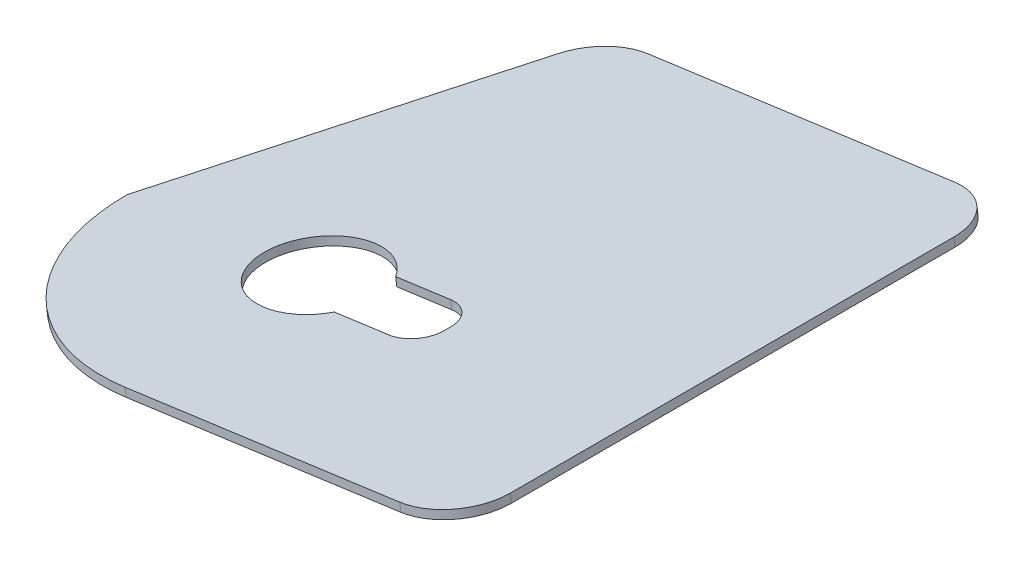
ISO-10303-21;
HEADER;
FILE_DESCRIPTION(('STEP AP214'),'2;1');
FILE_NAME('part.step','',(''),(''),'','','');
FILE_SCHEMA(('AUTOMOTIVE_DESIGN { 1 0 10303 214 1 1 1 1 }'));
ENDSEC;
DATA;
#1=APPLICATION_CONTEXT('core data for automotive mechanical design processes');
#2=APPLICATION_PROTOCOL_DEFINITION('international standard','automotive_design',2000,#1);
#3=PRODUCT_CONTEXT('',#1,'mechanical');
#4=PRODUCT('Part','Part','',(#3));
#5=PRODUCT_RELATED_PRODUCT_CATEGORY('part','',(#4));
#6=PRODUCT_DEFINITION_FORMATION('','',#4);
#7=PRODUCT_DEFINITION_CONTEXT('part definition',#1,'design');
#8=PRODUCT_DEFINITION('design','',#6,#7);
#9=PRODUCT_DEFINITION_SHAPE('','',#8);
#10=(LENGTH_UNIT() NAMED_UNIT(*) SI_UNIT(.MILLI.,.METRE.));
#11=(NAMED_UNIT(*) PLANE_ANGLE_UNIT() SI_UNIT($,.RADIAN.));
#12=(NAMED_UNIT(*) SI_UNIT($,.STERADIAN.) SOLID_ANGLE_UNIT());
#13=UNCERTAINTY_MEASURE_WITH_UNIT(LENGTH_MEASURE(1.E-05),#10,'distance_accuracy_value','');
#14=(GEOMETRIC_REPRESENTATION_CONTEXT(3) GLOBAL_UNCERTAINTY_ASSIGNED_CONTEXT((#13)) GLOBAL_UNIT_ASSIGNED_CONTEXT((#10,
#11,#12)) REPRESENTATION_CONTEXT('',''));
#15=CARTESIAN_POINT('',(0.,0.,0.));
#16=DIRECTION('',(0.,0.,1.));
#17=DIRECTION('',(1.,0.,0.));
#18=AXIS2_PLACEMENT_3D('',#15,#16,#17);
#19=CARTESIAN_POINT('',(15.02308683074,1.636620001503,68.5));
#20=DIRECTION('',(-0.136363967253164,0.990658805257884,0.));
#21=DIRECTION('',(-0.990658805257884,-0.136363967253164,0.));
#22=AXIS2_PLACEMENT_3D('',#19,#20,#21);
#23=PLANE('',#22);
#24=DIRECTION('',(0.990658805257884,0.136363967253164,0.));
#25=VECTOR('',#24,1.);
#26=CARTESIAN_POINT('',(10.129232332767,0.9629820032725,74.6467013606));
#27=LINE('',#26,#25);
#28=CARTESIAN_POINT('',(10.7067695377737,1.04247987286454,74.6467013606));
#29=VERTEX_POINT('',#28);
#30=CARTESIAN_POINT('',(9.71611073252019,0.906115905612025,74.6467013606));
#31=VERTEX_POINT('',#30);
#32=EDGE_CURVE('E119',#29,#31,#27,.F.);
#33=ORIENTED_EDGE('',*,*,#32,.F.);
#34=CARTESIAN_POINT('',(10.706769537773,1.04247987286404,75.1467013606));
#35=DIRECTION('',(0.136363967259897,-0.990658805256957,0.));
#36=DIRECTION('',(0.990658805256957,0.136363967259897,0.));
#37=AXIS2_PLACEMENT_3D('',#34,#35,#36);
#38=CIRCLE('',#37,0.500000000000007);
#39=CARTESIAN_POINT('',(11.2020989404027,1.11066185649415,75.1467013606));
#40=VERTEX_POINT('',#39);
#41=EDGE_CURVE('E20',#40,#29,#38,.F.);
#42=ORIENTED_EDGE('',*,*,#41,.F.);
#43=DIRECTION('',(0.,0.,1.));
#44=VECTOR('',#43,1.);
#45=CARTESIAN_POINT('',(11.2020989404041,1.11066185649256,75.2));
#46=LINE('',#45,#44);
#47=CARTESIAN_POINT('',(11.2020989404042,1.11066185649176,75.2532986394));
#48=VERTEX_POINT('',#47);
#49=EDGE_CURVE('E116',#40,#48,#46,.T.);
#50=ORIENTED_EDGE('',*,*,#49,.T.);
#51=CARTESIAN_POINT('',(10.7067695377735,1.04247987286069,75.2532986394));
#52=DIRECTION('',(0.136363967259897,-0.990658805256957,0.));
#53=DIRECTION('',(0.990658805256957,0.136363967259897,0.));
#54=AXIS2_PLACEMENT_3D('',#51,#52,#53);
#55=CIRCLE('',#54,0.500000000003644);
#56=CARTESIAN_POINT('',(10.706769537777,1.04247987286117,75.7532986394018));
#57=VERTEX_POINT('',#56);
#58=EDGE_CURVE('E151',#48,#57,#55,.T.);
#59=ORIENTED_EDGE('',*,*,#58,.T.);
#60=DIRECTION('',(-0.990658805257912,-0.136363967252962,0.));
#61=VECTOR('',#60,1.);
#62=CARTESIAN_POINT('',(10.2114401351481,0.974297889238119,75.7532986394));
#63=LINE('',#62,#61);
#64=CARTESIAN_POINT('',(9.71611073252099,0.906115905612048,75.7532986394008));
#65=VERTEX_POINT('',#64);
#66=EDGE_CURVE('E147',#57,#65,#63,.T.);
#67=ORIENTED_EDGE('',*,*,#66,.T.);
#68=CARTESIAN_POINT('',(8.890908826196,0.792527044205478,75.2));
#69=DIRECTION('',(-0.136363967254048,0.990658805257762,0.));
#70=DIRECTION('',(-0.990658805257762,-0.136363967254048,0.));
#71=AXIS2_PLACEMENT_3D('',#68,#69,#70);
#72=CIRCLE('',#71,1.00000000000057);
#73=EDGE_CURVE('E143',#65,#31,#72,.F.);
#74=ORIENTED_EDGE('',*,*,#73,.T.);
#75=EDGE_LOOP('',(#33,#42,#50,#59,#67,#74));
#76=FACE_BOUND('',#75,.T.);
#77=CARTESIAN_POINT('',(8.31361618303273,0.713062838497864,69.7));
#78=DIRECTION('',(0.136363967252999,-0.990658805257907,0.));
#79=DIRECTION('',(0.990658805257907,0.136363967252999,0.));
#80=AXIS2_PLACEMENT_3D('',#77,#78,#79);
#81=CIRCLE('',#80,1.00000000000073);
#82=CARTESIAN_POINT('',(8.31361618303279,0.713062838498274,68.6999999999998));
#83=VERTEX_POINT('',#82);
#84=CARTESIAN_POINT('',(7.37524834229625,0.583896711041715,69.3794038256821));
#85=VERTEX_POINT('',#84);
#86=EDGE_CURVE('E175',#83,#85,#81,.F.);
#87=ORIENTED_EDGE('',*,*,#86,.T.);
#88=DIRECTION('',(0.317601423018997,0.0437177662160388,-0.947215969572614));
#89=VECTOR('',#88,1.);
#90=CARTESIAN_POINT('',(6.39942567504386,0.449574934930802,72.289701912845));
#91=LINE('',#90,#89);
#92=CARTESIAN_POINT('',(5.42360300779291,0.3152531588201,75.2000000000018));
#93=VERTEX_POINT('',#92);
#94=EDGE_CURVE('E171',#85,#93,#91,.F.);
#95=ORIENTED_EDGE('',*,*,#94,.T.);
#96=CARTESIAN_POINT('',(8.89090882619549,0.792527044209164,75.2));
#97=DIRECTION('',(-0.136363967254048,0.990658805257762,0.));
#98=DIRECTION('',(-0.990658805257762,-0.136363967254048,0.));
#99=AXIS2_PLACEMENT_3D('',#96,#97,#98);
#100=CIRCLE('',#99,3.50000000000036);
#101=CARTESIAN_POINT('',(8.89090882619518,0.792527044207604,78.7));
#102=VERTEX_POINT('',#101);
#103=EDGE_CURVE('E167',#93,#102,#100,.T.);
#104=ORIENTED_EDGE('',*,*,#103,.T.);
#105=DIRECTION('',(-0.990658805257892,-0.136363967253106,0.));
#106=VECTOR('',#105,1.);
#107=CARTESIAN_POINT('',(11.3675558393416,1.13343696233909,78.7));
#108=LINE('',#107,#106);
#109=CARTESIAN_POINT('',(13.8442028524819,1.47434688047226,78.7000000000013));
#110=VERTEX_POINT('',#109);
#111=EDGE_CURVE('E163',#102,#110,#108,.F.);
#112=ORIENTED_EDGE('',*,*,#111,.T.);
#113=CARTESIAN_POINT('',(13.8442028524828,1.47434688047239,77.7));
#114=DIRECTION('',(0.136363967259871,-0.990658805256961,0.));
#115=DIRECTION('',(0.990658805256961,0.136363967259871,0.));
#116=AXIS2_PLACEMENT_3D('',#113,#114,#115);
#117=CIRCLE('',#116,0.999999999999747);
#118=CARTESIAN_POINT('',(14.8348616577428,1.61071084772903,77.7));
#119=VERTEX_POINT('',#118);
#120=EDGE_CURVE('E159',#110,#119,#117,.F.);
#121=ORIENTED_EDGE('',*,*,#120,.T.);
#122=DIRECTION('',(0.,0.,1.));
#123=VECTOR('',#122,1.);
#124=CARTESIAN_POINT('',(14.8348616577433,1.61071084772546,73.7));
#125=LINE('',#124,#123);
#126=CARTESIAN_POINT('',(14.8348616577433,1.6107108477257,69.7));
#127=VERTEX_POINT('',#126);
#128=EDGE_CURVE('E128',#119,#127,#125,.F.);
#129=ORIENTED_EDGE('',*,*,#128,.T.);
#130=CARTESIAN_POINT('',(13.8442028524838,1.47434688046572,69.7));
#131=DIRECTION('',(0.136363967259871,-0.990658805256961,0.));
#132=DIRECTION('',(0.990658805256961,0.136363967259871,0.));
#133=AXIS2_PLACEMENT_3D('',#130,#131,#132);
#134=CIRCLE('',#133,0.999999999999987);
#135=CARTESIAN_POINT('',(13.8442028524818,1.47434688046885,68.7));
#136=VERTEX_POINT('',#135);
#137=EDGE_CURVE('E182',#127,#136,#134,.F.);
#138=ORIENTED_EDGE('',*,*,#137,.T.);
#139=DIRECTION('',(0.990658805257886,0.136363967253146,0.));
#140=VECTOR('',#139,1.);
#141=CARTESIAN_POINT('',(11.0789095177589,1.09370485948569,68.7));
#142=LINE('',#141,#140);
#143=EDGE_CURVE('E179',#136,#83,#142,.F.);
#144=ORIENTED_EDGE('',*,*,#143,.T.);
#145=EDGE_LOOP('',(#87,#95,#104,#112,#121,#129,#138,#144));
#146=FACE_BOUND('',#145,.T.);
#147=ADVANCED_FACE('F16',(#76,#146),#23,.T.);
#148=CARTESIAN_POINT('',(13.8442028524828,1.47434688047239,69.7));
#149=DIRECTION('',(0.136363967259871,-0.990658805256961,0.));
#150=DIRECTION('',(0.990658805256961,0.136363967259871,0.));
#151=AXIS2_PLACEMENT_3D('',#148,#149,#150);
#152=CYLINDRICAL_SURFACE('',#151,0.999999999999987);
#153=ORIENTED_EDGE('',*,*,#137,.F.);
#154=DIRECTION('',(-0.136363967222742,0.990658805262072,0.));
#155=VECTOR('',#154,1.);
#156=CARTESIAN_POINT('',(14.845088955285,1.536411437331,69.7));
#157=LINE('',#156,#155);
#158=CARTESIAN_POINT('',(14.8553162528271,1.46211202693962,69.7));
#159=VERTEX_POINT('',#158);
#160=EDGE_CURVE('E156',#127,#159,#157,.F.);
#161=ORIENTED_EDGE('',*,*,#160,.T.);
#162=CARTESIAN_POINT('',(13.8646574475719,1.32574805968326,69.7));
#163=DIRECTION('',(0.136363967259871,-0.990658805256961,0.));
#164=DIRECTION('',(0.990658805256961,0.136363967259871,0.));
#165=AXIS2_PLACEMENT_3D('',#162,#163,#164);
#166=CIRCLE('',#165,0.999999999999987);
#167=CARTESIAN_POINT('',(13.8646574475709,1.32574805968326,68.7));
#168=VERTEX_POINT('',#167);
#169=EDGE_CURVE('E131',#159,#168,#166,.F.);
#170=ORIENTED_EDGE('',*,*,#169,.T.);
#171=DIRECTION('',(0.13636396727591,-0.990658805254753,0.));
#172=VECTOR('',#171,1.);
#173=CARTESIAN_POINT('',(13.8544301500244,1.40004747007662,68.7));
#174=LINE('',#173,#172);
#175=EDGE_CURVE('E180',#168,#136,#174,.F.);
#176=ORIENTED_EDGE('',*,*,#175,.T.);
#177=EDGE_LOOP('',(#153,#161,#170,#176));
#178=FACE_BOUND('',#177,.T.);
#179=ADVANCED_FACE('F226',(#178),#152,.T.);
#180=CARTESIAN_POINT('',(13.97752637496,1.324575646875,68.7));
#181=DIRECTION('',(0.,0.,-1.));
#182=DIRECTION('',(-0.990658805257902,-0.136363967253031,0.));
#183=AXIS2_PLACEMENT_3D('',#180,#181,#182);
#184=PLANE('',#183);
#185=DIRECTION('',(-0.136363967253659,0.990658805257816,-1.97057225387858E-12));
#186=VECTOR('',#185,1.);
#187=CARTESIAN_POINT('',(8.32384348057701,0.638763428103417,68.6999999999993));
#188=LINE('',#187,#186);
#189=CARTESIAN_POINT('',(8.33407077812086,0.564464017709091,68.6999999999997));
#190=VERTEX_POINT('',#189);
#191=EDGE_CURVE('E176',#190,#83,#188,.T.);
#192=ORIENTED_EDGE('',*,*,#191,.T.);
#193=ORIENTED_EDGE('',*,*,#143,.F.);
#194=ORIENTED_EDGE('',*,*,#175,.F.);
#195=DIRECTION('',(-0.990658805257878,-0.136363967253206,0.));
#196=VECTOR('',#195,1.);
#197=CARTESIAN_POINT('',(10.149686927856,0.81438318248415,68.7));
#198=LINE('',#197,#196);
#199=EDGE_CURVE('E134',#168,#190,#198,.T.);
#200=ORIENTED_EDGE('',*,*,#199,.T.);
#201=EDGE_LOOP('',(#192,#193,#194,#200));
#202=FACE_BOUND('',#201,.T.);
#203=ADVANCED_FACE('F223',(#202),#184,.T.);
#204=CARTESIAN_POINT('',(8.31361618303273,0.713062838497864,69.7));
#205=DIRECTION('',(0.136363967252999,-0.990658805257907,0.));
#206=DIRECTION('',(0.990658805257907,0.136363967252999,0.));
#207=AXIS2_PLACEMENT_3D('',#204,#205,#206);
#208=CYLINDRICAL_SURFACE('',#207,1.00000000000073);
#209=ORIENTED_EDGE('',*,*,#86,.F.);
#210=ORIENTED_EDGE('',*,*,#191,.F.);
#211=CARTESIAN_POINT('',(8.3340707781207,0.564464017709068,69.7));
#212=DIRECTION('',(0.136363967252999,-0.990658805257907,0.));
#213=DIRECTION('',(0.990658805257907,0.136363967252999,0.));
#214=AXIS2_PLACEMENT_3D('',#211,#212,#213);
#215=CIRCLE('',#214,1.00000000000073);
#216=CARTESIAN_POINT('',(7.3957029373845,0.435297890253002,69.3794038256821));
#217=VERTEX_POINT('',#216);
#218=EDGE_CURVE('E210',#190,#217,#215,.F.);
#219=ORIENTED_EDGE('',*,*,#218,.T.);
#220=DIRECTION('',(0.136363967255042,-0.990658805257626,0.));
#221=VECTOR('',#220,1.);
#222=CARTESIAN_POINT('',(7.38547563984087,0.509597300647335,69.3794038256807));
#223=LINE('',#222,#221);
#224=EDGE_CURVE('E172',#217,#85,#223,.F.);
#225=ORIENTED_EDGE('',*,*,#224,.T.);
#226=EDGE_LOOP('',(#209,#210,#219,#225));
#227=FACE_BOUND('',#226,.T.);
#228=ADVANCED_FACE('F235',(#227),#208,.T.);
#229=CARTESIAN_POINT('',(7.436993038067,0.4242726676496,69.2629919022));
#230=DIRECTION('',(-0.938367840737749,-0.129166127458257,-0.320596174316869));
#231=DIRECTION('',(-0.317601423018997,-0.0437177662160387,0.947215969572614));
#232=AXIS2_PLACEMENT_3D('',#229,#230,#231);
#233=PLANE('',#232);
#234=DIRECTION('',(-0.136363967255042,0.990658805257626,0.));
#235=VECTOR('',#234,1.);
#236=CARTESIAN_POINT('',(5.433830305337,0.2409537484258,75.2));
#237=LINE('',#236,#235);
#238=CARTESIAN_POINT('',(5.44405760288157,0.166654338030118,75.2000000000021));
#239=VERTEX_POINT('',#238);
#240=EDGE_CURVE('E168',#239,#93,#237,.T.);
#241=ORIENTED_EDGE('',*,*,#240,.T.);
#242=ORIENTED_EDGE('',*,*,#94,.F.);
#243=ORIENTED_EDGE('',*,*,#224,.F.);
#244=DIRECTION('',(-0.317601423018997,-0.0437177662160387,0.947215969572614));
#245=VECTOR('',#244,1.);
#246=CARTESIAN_POINT('',(7.43473584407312,0.440670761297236,69.2629919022));
#247=LINE('',#246,#245);
#248=EDGE_CURVE('E207',#217,#239,#247,.T.);
#249=ORIENTED_EDGE('',*,*,#248,.T.);
#250=EDGE_LOOP('',(#241,#242,#243,#249));
#251=FACE_BOUND('',#250,.T.);
#252=ADVANCED_FACE('F239',(#251),#233,.T.);
#253=CARTESIAN_POINT('',(8.911363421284,0.6439282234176,75.2));
#254=DIRECTION('',(-0.136363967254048,0.990658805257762,0.));
#255=DIRECTION('',(-0.990658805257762,-0.136363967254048,0.));
#256=AXIS2_PLACEMENT_3D('',#253,#254,#255);
#257=CYLINDRICAL_SURFACE('',#256,3.50000000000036);
#258=ORIENTED_EDGE('',*,*,#103,.F.);
#259=ORIENTED_EDGE('',*,*,#240,.F.);
#260=CARTESIAN_POINT('',(8.911363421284,0.6439282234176,75.2));
#261=DIRECTION('',(-0.136363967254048,0.990658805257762,0.));
#262=DIRECTION('',(-0.990658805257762,-0.136363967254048,0.));
#263=AXIS2_PLACEMENT_3D('',#260,#261,#262);
#264=CIRCLE('',#263,3.50000000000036);
#265=CARTESIAN_POINT('',(8.9113634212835,0.643928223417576,78.7));
#266=VERTEX_POINT('',#265);
#267=EDGE_CURVE('E204',#239,#266,#264,.T.);
#268=ORIENTED_EDGE('',*,*,#267,.T.);
#269=DIRECTION('',(0.136363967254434,-0.990658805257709,0.));
#270=VECTOR('',#269,1.);
#271=CARTESIAN_POINT('',(8.90113612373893,0.718227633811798,78.7));
#272=LINE('',#271,#270);
#273=EDGE_CURVE('E164',#266,#102,#272,.F.);
#274=ORIENTED_EDGE('',*,*,#273,.T.);
#275=EDGE_LOOP('',(#258,#259,#268,#274));
#276=FACE_BOUND('',#275,.T.);
#277=ADVANCED_FACE('F241',(#276),#257,.T.);
#278=CARTESIAN_POINT('',(8.814554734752,0.6138937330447,78.7));
#279=DIRECTION('',(0.,0.,1.));
#280=DIRECTION('',(0.990658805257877,0.136363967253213,0.));
#281=AXIS2_PLACEMENT_3D('',#278,#279,#280);
#282=PLANE('',#281);
#283=ORIENTED_EDGE('',*,*,#273,.F.);
#284=DIRECTION('',(0.990658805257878,0.136363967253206,0.));
#285=VECTOR('',#284,1.);
#286=CARTESIAN_POINT('',(10.149686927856,0.81438318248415,78.7));
#287=LINE('',#286,#285);
#288=CARTESIAN_POINT('',(13.8646574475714,1.32574805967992,78.6999999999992));
#289=VERTEX_POINT('',#288);
#290=EDGE_CURVE('E203',#266,#289,#287,.T.);
#291=ORIENTED_EDGE('',*,*,#290,.T.);
#292=DIRECTION('',(-0.136363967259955,0.990658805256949,3.75166640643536E-11));
#293=VECTOR('',#292,1.);
#294=CARTESIAN_POINT('',(13.8544301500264,1.4000474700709,78.6999999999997));
#295=LINE('',#294,#293);
#296=EDGE_CURVE('E160',#289,#110,#295,.T.);
#297=ORIENTED_EDGE('',*,*,#296,.T.);
#298=ORIENTED_EDGE('',*,*,#111,.F.);
#299=EDGE_LOOP('',(#283,#291,#297,#298));
#300=FACE_BOUND('',#299,.T.);
#301=ADVANCED_FACE('F349',(#300),#282,.T.);
#302=CARTESIAN_POINT('',(13.8442028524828,1.47434688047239,77.7));
#303=DIRECTION('',(0.136363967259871,-0.990658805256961,0.));
#304=DIRECTION('',(0.990658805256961,0.136363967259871,0.));
#305=AXIS2_PLACEMENT_3D('',#302,#303,#304);
#306=CYLINDRICAL_SURFACE('',#305,0.999999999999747);
#307=ORIENTED_EDGE('',*,*,#120,.F.);
#308=ORIENTED_EDGE('',*,*,#296,.F.);
#309=CARTESIAN_POINT('',(13.8646574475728,1.32574805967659,77.7));
#310=DIRECTION('',(0.136363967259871,-0.990658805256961,0.));
#311=DIRECTION('',(0.990658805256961,0.136363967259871,0.));
#312=AXIS2_PLACEMENT_3D('',#309,#310,#311);
#313=CIRCLE('',#312,0.999999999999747);
#314=CARTESIAN_POINT('',(14.8553162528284,1.46211202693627,77.7));
#315=VERTEX_POINT('',#314);
#316=EDGE_CURVE('E199',#289,#315,#313,.F.);
#317=ORIENTED_EDGE('',*,*,#316,.T.);
#318=DIRECTION('',(0.136363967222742,-0.990658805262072,0.));
#319=VECTOR('',#318,1.);
#320=CARTESIAN_POINT('',(14.845088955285,1.536411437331,77.7));
#321=LINE('',#320,#319);
#322=EDGE_CURVE('E153',#315,#119,#321,.F.);
#323=ORIENTED_EDGE('',*,*,#322,.T.);
#324=EDGE_LOOP('',(#307,#308,#317,#323));
#325=FACE_BOUND('',#324,.T.);
#326=ADVANCED_FACE('F340',(#325),#306,.T.);
#327=CARTESIAN_POINT('',(14.85757344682,1.445713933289,77.86));
#328=DIRECTION('',(0.990658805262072,0.136363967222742,0.));
#329=DIRECTION('',(0.,0.,-1.));
#330=AXIS2_PLACEMENT_3D('',#327,#328,#329);
#331=PLANE('',#330);
#332=ORIENTED_EDGE('',*,*,#322,.F.);
#333=DIRECTION('',(0.,0.,-1.));
#334=VECTOR('',#333,1.);
#335=CARTESIAN_POINT('',(14.85531625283,1.46211202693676,73.7));
#336=LINE('',#335,#334);
#337=EDGE_CURVE('E202',#315,#159,#336,.T.);
#338=ORIENTED_EDGE('',*,*,#337,.T.);
#339=ORIENTED_EDGE('',*,*,#160,.F.);
#340=ORIENTED_EDGE('',*,*,#128,.F.);
#341=EDGE_LOOP('',(#332,#338,#339,#340));
#342=FACE_BOUND('',#341,.T.);
#343=ADVANCED_FACE('F274',(#342),#331,.T.);
#344=CARTESIAN_POINT('',(11.22481072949,0.9456649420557,75.26985135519));
#345=DIRECTION('',(0.990658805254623,0.136363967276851,0.));
#346=DIRECTION('',(0.,0.,-1.));
#347=AXIS2_PLACEMENT_3D('',#344,#345,#346);
#348=PLANE('',#347);
#349=DIRECTION('',(0.136363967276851,-0.990658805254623,0.));
#350=VECTOR('',#349,1.);
#351=CARTESIAN_POINT('',(11.21232623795,1.03636244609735,75.2532986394));
#352=LINE('',#351,#350);
#353=CARTESIAN_POINT('',(11.2225535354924,0.962063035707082,75.2532986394));
#354=VERTEX_POINT('',#353);
#355=EDGE_CURVE('E127',#354,#48,#352,.F.);
#356=ORIENTED_EDGE('',*,*,#355,.T.);
#357=ORIENTED_EDGE('',*,*,#49,.F.);
#358=DIRECTION('',(-0.136363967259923,0.990658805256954,-1.66740729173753E-11));
#359=VECTOR('',#358,1.);
#360=CARTESIAN_POINT('',(11.2123262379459,1.03636244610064,75.1467013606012));
#361=LINE('',#360,#359);
#362=CARTESIAN_POINT('',(11.2225535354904,0.962063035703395,75.1467013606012));
#363=VERTEX_POINT('',#362);
#364=EDGE_CURVE('E126',#40,#363,#361,.F.);
#365=ORIENTED_EDGE('',*,*,#364,.T.);
#366=DIRECTION('',(0.,0.,1.));
#367=VECTOR('',#366,1.);
#368=CARTESIAN_POINT('',(11.22255353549,0.96206303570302,73.7));
#369=LINE('',#368,#367);
#370=EDGE_CURVE('E198',#363,#354,#369,.T.);
#371=ORIENTED_EDGE('',*,*,#370,.T.);
#372=EDGE_LOOP('',(#356,#357,#365,#371));
#373=FACE_BOUND('',#372,.T.);
#374=ADVANCED_FACE('F124',(#373),#348,.F.);
#375=CARTESIAN_POINT('',(10.7067695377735,1.04247987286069,75.2532986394));
#376=DIRECTION('',(0.136363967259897,-0.990658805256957,0.));
#377=DIRECTION('',(0.990658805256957,0.136363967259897,0.));
#378=AXIS2_PLACEMENT_3D('',#375,#376,#377);
#379=CYLINDRICAL_SURFACE('',#378,0.500000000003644);
#380=DIRECTION('',(-0.136363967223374,0.990658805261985,0.));
#381=VECTOR('',#380,1.);
#382=CARTESIAN_POINT('',(10.7169968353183,0.968180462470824,75.7532986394));
#383=LINE('',#382,#381);
#384=CARTESIAN_POINT('',(10.7272241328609,0.893881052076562,75.7532986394));
#385=VERTEX_POINT('',#384);
#386=EDGE_CURVE('E148',#385,#57,#383,.T.);
#387=ORIENTED_EDGE('',*,*,#386,.T.);
#388=ORIENTED_EDGE('',*,*,#58,.F.);
#389=ORIENTED_EDGE('',*,*,#355,.F.);
#390=CARTESIAN_POINT('',(10.7272241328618,0.893881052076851,75.2532986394));
#391=DIRECTION('',(0.136363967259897,-0.990658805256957,0.));
#392=DIRECTION('',(0.990658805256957,0.136363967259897,0.));
#393=AXIS2_PLACEMENT_3D('',#390,#391,#392);
#394=CIRCLE('',#393,0.500000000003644);
#395=EDGE_CURVE('E195',#354,#385,#394,.T.);
#396=ORIENTED_EDGE('',*,*,#395,.T.);
#397=EDGE_LOOP('',(#387,#388,#389,#396));
#398=FACE_BOUND('',#397,.T.);
#399=ADVANCED_FACE('F265',(#398),#379,.F.);
#400=CARTESIAN_POINT('',(9.719009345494,0.7383917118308,75.7532986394));
#401=DIRECTION('',(0.,0.,1.));
#402=DIRECTION('',(0.99065880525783,0.136363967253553,0.));
#403=AXIS2_PLACEMENT_3D('',#400,#401,#402);
#404=PLANE('',#403);
#405=DIRECTION('',(0.136363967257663,-0.990658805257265,2.42531969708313E-12));
#406=VECTOR('',#405,1.);
#407=CARTESIAN_POINT('',(9.72633803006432,0.831816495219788,75.7532986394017));
#408=LINE('',#407,#406);
#409=CARTESIAN_POINT('',(9.73656532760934,0.757517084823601,75.753298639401));
#410=VERTEX_POINT('',#409);
#411=EDGE_CURVE('E144',#410,#65,#408,.F.);
#412=ORIENTED_EDGE('',*,*,#411,.T.);
#413=ORIENTED_EDGE('',*,*,#66,.F.);
#414=ORIENTED_EDGE('',*,*,#386,.F.);
#415=DIRECTION('',(-0.990658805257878,-0.136363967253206,0.));
#416=VECTOR('',#415,1.);
#417=CARTESIAN_POINT('',(10.149686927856,0.81438318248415,75.7532986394));
#418=LINE('',#417,#416);
#419=EDGE_CURVE('E194',#385,#410,#418,.T.);
#420=ORIENTED_EDGE('',*,*,#419,.T.);
#421=EDGE_LOOP('',(#412,#413,#414,#420));
#422=FACE_BOUND('',#421,.T.);
#423=ADVANCED_FACE('F262',(#422),#404,.F.);
#424=CARTESIAN_POINT('',(8.9113634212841,0.643928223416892,75.2));
#425=DIRECTION('',(-0.136363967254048,0.990658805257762,0.));
#426=DIRECTION('',(-0.990658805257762,-0.136363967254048,0.));
#427=AXIS2_PLACEMENT_3D('',#424,#425,#426);
#428=CYLINDRICAL_SURFACE('',#427,1.00000000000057);
#429=ORIENTED_EDGE('',*,*,#73,.F.);
#430=ORIENTED_EDGE('',*,*,#411,.F.);
#431=CARTESIAN_POINT('',(8.9113634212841,0.643928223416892,75.2));
#432=DIRECTION('',(-0.136363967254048,0.990658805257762,0.));
#433=DIRECTION('',(-0.990658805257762,-0.136363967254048,0.));
#434=AXIS2_PLACEMENT_3D('',#431,#432,#433);
#435=CIRCLE('',#434,1.00000000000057);
#436=CARTESIAN_POINT('',(9.73656532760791,0.757517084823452,74.6467013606));
#437=VERTEX_POINT('',#436);
#438=EDGE_CURVE('E191',#410,#437,#435,.F.);
#439=ORIENTED_EDGE('',*,*,#438,.T.);
#440=DIRECTION('',(-0.136363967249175,0.990658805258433,0.));
#441=VECTOR('',#440,1.);
#442=CARTESIAN_POINT('',(9.72633803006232,0.831816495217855,74.6467013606));
#443=LINE('',#442,#441);
#444=EDGE_CURVE('E136',#437,#31,#443,.T.);
#445=ORIENTED_EDGE('',*,*,#444,.T.);
#446=EDGE_LOOP('',(#429,#430,#439,#445));
#447=FACE_BOUND('',#446,.T.);
#448=ADVANCED_FACE('F259',(#447),#428,.F.);
#449=CARTESIAN_POINT('',(10.74929450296,0.8802102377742,74.6467013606));
#450=DIRECTION('',(0.,0.,-1.));
#451=DIRECTION('',(-0.99065880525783,-0.136363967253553,0.));
#452=AXIS2_PLACEMENT_3D('',#449,#450,#451);
#453=PLANE('',#452);
#454=ORIENTED_EDGE('',*,*,#444,.F.);
#455=DIRECTION('',(0.990658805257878,0.136363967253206,0.));
#456=VECTOR('',#455,1.);
#457=CARTESIAN_POINT('',(10.149686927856,0.81438318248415,74.6467013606));
#458=LINE('',#457,#456);
#459=CARTESIAN_POINT('',(10.727224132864,0.893881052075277,74.6467013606));
#460=VERTEX_POINT('',#459);
#461=EDGE_CURVE('E26',#437,#460,#458,.T.);
#462=ORIENTED_EDGE('',*,*,#461,.T.);
#463=DIRECTION('',(0.136363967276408,-0.990658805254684,0.));
#464=VECTOR('',#463,1.);
#465=CARTESIAN_POINT('',(10.71699683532,0.96818046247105,74.6467013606));
#466=LINE('',#465,#464);
#467=EDGE_CURVE('E34',#460,#29,#466,.F.);
#468=ORIENTED_EDGE('',*,*,#467,.T.);
#469=ORIENTED_EDGE('',*,*,#32,.T.);
#470=EDGE_LOOP('',(#454,#462,#468,#469));
#471=FACE_BOUND('',#470,.T.);
#472=ADVANCED_FACE('F253',(#471),#453,.F.);
#473=CARTESIAN_POINT('',(10.706769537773,1.04247987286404,75.1467013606));
#474=DIRECTION('',(0.136363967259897,-0.990658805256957,0.));
#475=DIRECTION('',(0.990658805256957,0.136363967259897,0.));
#476=AXIS2_PLACEMENT_3D('',#473,#474,#475);
#477=CYLINDRICAL_SURFACE('',#476,0.500000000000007);
#478=ORIENTED_EDGE('',*,*,#364,.F.);
#479=ORIENTED_EDGE('',*,*,#41,.T.);
#480=ORIENTED_EDGE('',*,*,#467,.F.);
#481=CARTESIAN_POINT('',(10.7272241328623,0.893881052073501,75.1467013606));
#482=DIRECTION('',(0.136363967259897,-0.990658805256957,0.));
#483=DIRECTION('',(0.990658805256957,0.136363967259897,0.));
#484=AXIS2_PLACEMENT_3D('',#481,#482,#483);
#485=CIRCLE('',#484,0.500000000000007);
#486=EDGE_CURVE('E11',#460,#363,#485,.T.);
#487=ORIENTED_EDGE('',*,*,#486,.T.);
#488=EDGE_LOOP('',(#478,#479,#480,#487));
#489=FACE_BOUND('',#488,.T.);
#490=ADVANCED_FACE('F130',(#489),#477,.F.);
#491=CARTESIAN_POINT('',(15.04354142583,1.488021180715,68.5));
#492=DIRECTION('',(-0.136363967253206,0.990658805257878,0.));
#493=DIRECTION('',(-0.990658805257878,-0.136363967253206,0.));
#494=AXIS2_PLACEMENT_3D('',#491,#492,#493);
#495=PLANE('',#494);
#496=ORIENTED_EDGE('',*,*,#461,.F.);
#497=ORIENTED_EDGE('',*,*,#438,.F.);
#498=ORIENTED_EDGE('',*,*,#419,.F.);
#499=ORIENTED_EDGE('',*,*,#395,.F.);
#500=ORIENTED_EDGE('',*,*,#370,.F.);
#501=ORIENTED_EDGE('',*,*,#486,.F.);
#502=EDGE_LOOP('',(#496,#497,#498,#499,#500,#501));
#503=FACE_BOUND('',#502,.T.);
#504=ORIENTED_EDGE('',*,*,#316,.F.);
#505=ORIENTED_EDGE('',*,*,#290,.F.);
#506=ORIENTED_EDGE('',*,*,#267,.F.);
#507=ORIENTED_EDGE('',*,*,#248,.F.);
#508=ORIENTED_EDGE('',*,*,#218,.F.);
#509=ORIENTED_EDGE('',*,*,#199,.F.);
#510=ORIENTED_EDGE('',*,*,#169,.F.);
#511=ORIENTED_EDGE('',*,*,#337,.F.);
#512=EDGE_LOOP('',(#504,#505,#506,#507,#508,#509,#510,#511));
#513=FACE_BOUND('',#512,.T.);
#514=ADVANCED_FACE('F18',(#503,#513),#495,.F.);
#515=CLOSED_SHELL('',(#147,#179,#203,#228,#252,#277,#301,#326,#343,#374,#399,#423,#448,#472,
#490,#514));
#516=MANIFOLD_SOLID_BREP('B1',#515);
#517=ADVANCED_BREP_SHAPE_REPRESENTATION('',(#18,#516),#14);
#518=SHAPE_DEFINITION_REPRESENTATION(#9,#517);
ENDSEC;
END-ISO-10303-21;
